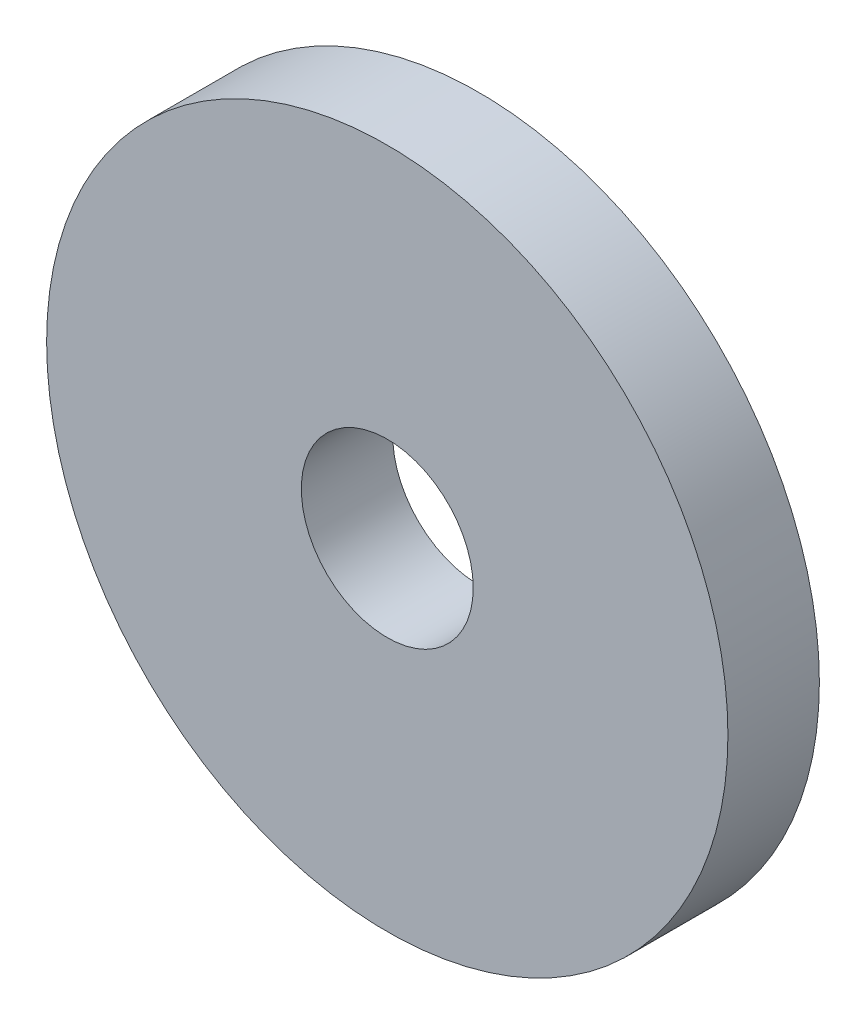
ISO-10303-21;
HEADER;
FILE_DESCRIPTION(('STEP AP214'),'2;1');
FILE_NAME('part.step','',(''),(''),'','','');
FILE_SCHEMA(('AUTOMOTIVE_DESIGN { 1 0 10303 214 1 1 1 1 }'));
ENDSEC;
DATA;
#1=APPLICATION_CONTEXT('core data for automotive mechanical design processes');
#2=APPLICATION_PROTOCOL_DEFINITION('international standard','automotive_design',2000,#1);
#3=PRODUCT_CONTEXT('',#1,'mechanical');
#4=PRODUCT('Part','Part','',(#3));
#5=PRODUCT_RELATED_PRODUCT_CATEGORY('part','',(#4));
#6=PRODUCT_DEFINITION_FORMATION('','',#4);
#7=PRODUCT_DEFINITION_CONTEXT('part definition',#1,'design');
#8=PRODUCT_DEFINITION('design','',#6,#7);
#9=PRODUCT_DEFINITION_SHAPE('','',#8);
#10=(LENGTH_UNIT() NAMED_UNIT(*) SI_UNIT(.MILLI.,.METRE.));
#11=(NAMED_UNIT(*) PLANE_ANGLE_UNIT() SI_UNIT($,.RADIAN.));
#12=(NAMED_UNIT(*) SI_UNIT($,.STERADIAN.) SOLID_ANGLE_UNIT());
#13=UNCERTAINTY_MEASURE_WITH_UNIT(LENGTH_MEASURE(1.E-05),#10,'distance_accuracy_value','');
#14=(GEOMETRIC_REPRESENTATION_CONTEXT(3) GLOBAL_UNCERTAINTY_ASSIGNED_CONTEXT((#13)) GLOBAL_UNIT_ASSIGNED_CONTEXT((#10,
#11,#12)) REPRESENTATION_CONTEXT('',''));
#15=CARTESIAN_POINT('',(0.,0.,0.));
#16=DIRECTION('',(0.,0.,1.));
#17=DIRECTION('',(1.,0.,0.));
#18=AXIS2_PLACEMENT_3D('',#15,#16,#17);
#19=CARTESIAN_POINT('',(0.,0.,2.54));
#20=DIRECTION('',(0.,0.,1.));
#21=DIRECTION('',(1.,0.,0.));
#22=AXIS2_PLACEMENT_3D('',#19,#20,#21);
#23=PLANE('',#22);
#24=CARTESIAN_POINT('',(0.,0.,2.54));
#25=DIRECTION('',(0.,0.,1.));
#26=DIRECTION('',(1.,0.,0.));
#27=AXIS2_PLACEMENT_3D('',#24,#25,#26);
#28=CIRCLE('',#27,9.4615);
#29=CARTESIAN_POINT('',(9.46150000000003,0.,2.54));
#30=VERTEX_POINT('',#29);
#31=EDGE_CURVE('E10',#30,#30,#28,.T.);
#32=ORIENTED_EDGE('',*,*,#31,.T.);
#33=EDGE_LOOP('',(#32));
#34=FACE_BOUND('',#33,.T.);
#35=CARTESIAN_POINT('',(0.,0.,2.54));
#36=DIRECTION('',(0.,0.,1.));
#37=DIRECTION('',(1.,0.,0.));
#38=AXIS2_PLACEMENT_3D('',#35,#36,#37);
#39=CIRCLE('',#38,2.3876);
#40=CARTESIAN_POINT('',(2.38760000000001,0.,2.54));
#41=VERTEX_POINT('',#40);
#42=EDGE_CURVE('E41',#41,#41,#39,.T.);
#43=ORIENTED_EDGE('',*,*,#42,.F.);
#44=EDGE_LOOP('',(#43));
#45=FACE_BOUND('',#44,.T.);
#46=ADVANCED_FACE('F30',(#34,#45),#23,.T.);
#47=CARTESIAN_POINT('',(0.,0.,0.));
#48=DIRECTION('',(0.,0.,1.));
#49=DIRECTION('',(1.,0.,0.));
#50=AXIS2_PLACEMENT_3D('',#47,#48,#49);
#51=PLANE('',#50);
#52=CARTESIAN_POINT('',(0.,0.,0.));
#53=DIRECTION('',(0.,0.,1.));
#54=DIRECTION('',(1.,0.,0.));
#55=AXIS2_PLACEMENT_3D('',#52,#53,#54);
#56=CIRCLE('',#55,9.4615);
#57=CARTESIAN_POINT('',(9.46150000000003,0.,0.));
#58=VERTEX_POINT('',#57);
#59=EDGE_CURVE('E37',#58,#58,#56,.T.);
#60=ORIENTED_EDGE('',*,*,#59,.F.);
#61=EDGE_LOOP('',(#60));
#62=FACE_BOUND('',#61,.T.);
#63=CARTESIAN_POINT('',(0.,0.,0.));
#64=DIRECTION('',(0.,0.,1.));
#65=DIRECTION('',(1.,0.,0.));
#66=AXIS2_PLACEMENT_3D('',#63,#64,#65);
#67=CIRCLE('',#66,2.3876);
#68=CARTESIAN_POINT('',(2.38760000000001,0.,0.));
#69=VERTEX_POINT('',#68);
#70=EDGE_CURVE('E45',#69,#69,#67,.T.);
#71=ORIENTED_EDGE('',*,*,#70,.T.);
#72=EDGE_LOOP('',(#71));
#73=FACE_BOUND('',#72,.T.);
#74=ADVANCED_FACE('F51',(#62,#73),#51,.F.);
#75=CARTESIAN_POINT('',(0.,0.,2.54));
#76=DIRECTION('',(0.,0.,-1.));
#77=DIRECTION('',(-1.,0.,0.));
#78=AXIS2_PLACEMENT_3D('',#75,#76,#77);
#79=CYLINDRICAL_SURFACE('',#78,9.4615);
#80=ORIENTED_EDGE('',*,*,#31,.F.);
#81=EDGE_LOOP('',(#80));
#82=FACE_BOUND('',#81,.T.);
#83=ORIENTED_EDGE('',*,*,#59,.T.);
#84=EDGE_LOOP('',(#83));
#85=FACE_BOUND('',#84,.T.);
#86=ADVANCED_FACE('F32',(#82,#85),#79,.T.);
#87=CARTESIAN_POINT('',(0.,0.,2.54));
#88=DIRECTION('',(0.,0.,-1.));
#89=DIRECTION('',(-1.,0.,0.));
#90=AXIS2_PLACEMENT_3D('',#87,#88,#89);
#91=CYLINDRICAL_SURFACE('',#90,2.3876);
#92=ORIENTED_EDGE('',*,*,#42,.T.);
#93=EDGE_LOOP('',(#92));
#94=FACE_BOUND('',#93,.T.);
#95=ORIENTED_EDGE('',*,*,#70,.F.);
#96=EDGE_LOOP('',(#95));
#97=FACE_BOUND('',#96,.T.);
#98=ADVANCED_FACE('F53',(#94,#97),#91,.F.);
#99=CLOSED_SHELL('',(#46,#74,#86,#98));
#100=MANIFOLD_SOLID_BREP('B2',#99);
#101=ADVANCED_BREP_SHAPE_REPRESENTATION('',(#18,#100),#14);
#102=SHAPE_DEFINITION_REPRESENTATION(#9,#101);
ENDSEC;
END-ISO-10303-21;
